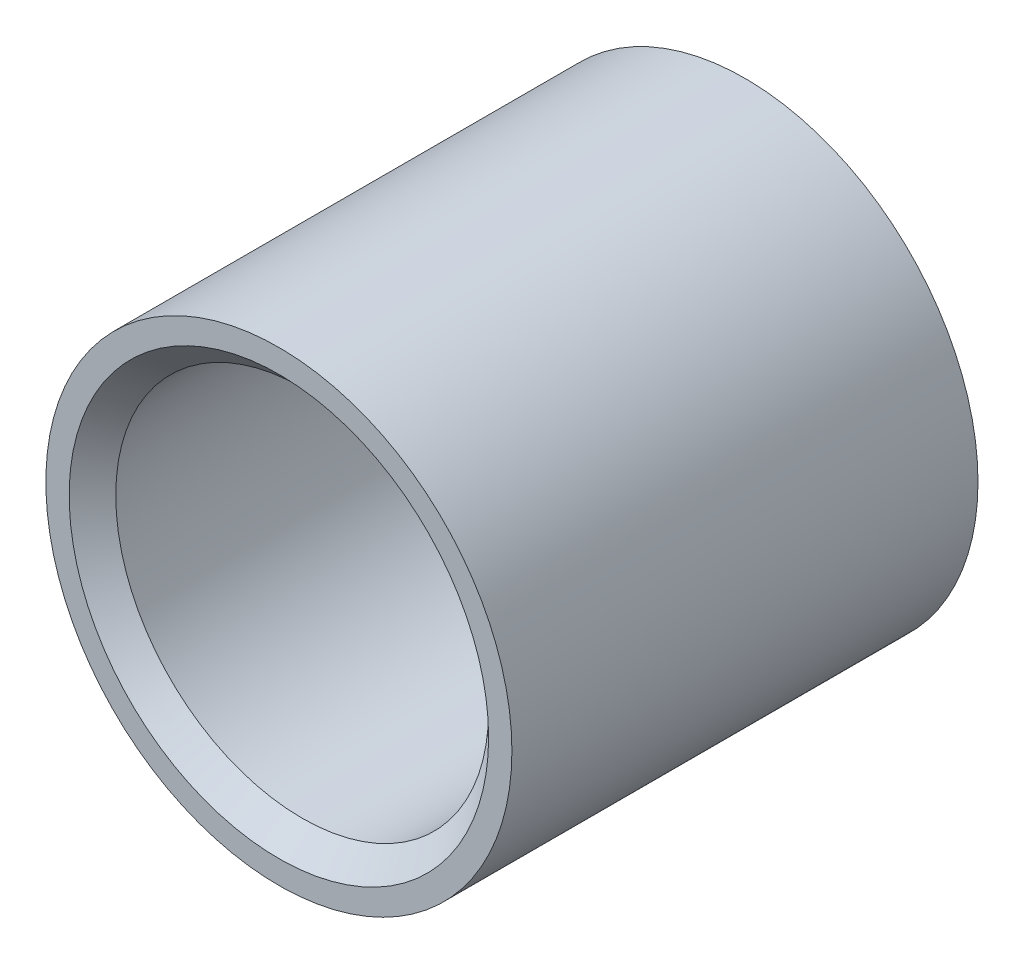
from build123d import *

# Parameters (mm, degrees)
ESQUISSE1_R        = 2.5
ESQUISSE1_R_2      = 2
BOSS_EXTRU_1_DEPTH = 5
CHANFREIN1_SIZE    = 0.25


with BuildPart() as part:
    # Esquisse1 → Boss.-Extru.1 (new body)
    with BuildSketch(Plane.XY):
        Circle(ESQUISSE1_R)
        Circle(ESQUISSE1_R_2, mode=Mode.SUBTRACT)
    extrude(amount=BOSS_EXTRU_1_DEPTH)

    # Chanfrein1
    chanfrein1_edges = [part.edges().sort_by_distance(p)[0] for p in [
        (-2, 0, 0),
        (-2, 0, 5),
    ]]
    chamfer(chanfrein1_edges, length=CHANFREIN1_SIZE)


solid = part.part
